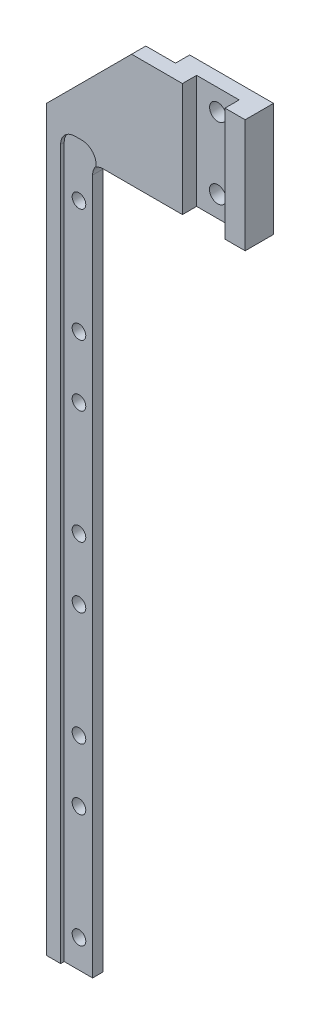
ISO-10303-21;
HEADER;
FILE_DESCRIPTION(('STEP AP214'),'2;1');
FILE_NAME('part.step','',(''),(''),'','','');
FILE_SCHEMA(('AUTOMOTIVE_DESIGN { 1 0 10303 214 1 1 1 1 }'));
ENDSEC;
DATA;
#1=APPLICATION_CONTEXT('core data for automotive mechanical design processes');
#2=APPLICATION_PROTOCOL_DEFINITION('international standard','automotive_design',2000,#1);
#3=PRODUCT_CONTEXT('',#1,'mechanical');
#4=PRODUCT('Part','Part','',(#3));
#5=PRODUCT_RELATED_PRODUCT_CATEGORY('part','',(#4));
#6=PRODUCT_DEFINITION_FORMATION('','',#4);
#7=PRODUCT_DEFINITION_CONTEXT('part definition',#1,'design');
#8=PRODUCT_DEFINITION('design','',#6,#7);
#9=PRODUCT_DEFINITION_SHAPE('','',#8);
#10=(LENGTH_UNIT() NAMED_UNIT(*) SI_UNIT(.MILLI.,.METRE.));
#11=(NAMED_UNIT(*) PLANE_ANGLE_UNIT() SI_UNIT($,.RADIAN.));
#12=(NAMED_UNIT(*) SI_UNIT($,.STERADIAN.) SOLID_ANGLE_UNIT());
#13=UNCERTAINTY_MEASURE_WITH_UNIT(LENGTH_MEASURE(1.E-05),#10,'distance_accuracy_value','');
#14=(GEOMETRIC_REPRESENTATION_CONTEXT(3) GLOBAL_UNCERTAINTY_ASSIGNED_CONTEXT((#13)) GLOBAL_UNIT_ASSIGNED_CONTEXT((#10,
#11,#12)) REPRESENTATION_CONTEXT('',''));
#15=CARTESIAN_POINT('',(0.,0.,0.));
#16=DIRECTION('',(0.,0.,1.));
#17=DIRECTION('',(1.,0.,0.));
#18=AXIS2_PLACEMENT_3D('',#15,#16,#17);
#19=CARTESIAN_POINT('',(-12.7,69.85,3.175));
#20=DIRECTION('',(0.,0.,-1.));
#21=DIRECTION('',(-1.,0.,0.));
#22=AXIS2_PLACEMENT_3D('',#19,#20,#21);
#23=PLANE('',#22);
#24=DIRECTION('',(-1.,0.,0.));
#25=VECTOR('',#24,1.);
#26=CARTESIAN_POINT('',(-7.93750000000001,82.55,3.175));
#27=LINE('',#26,#25);
#28=CARTESIAN_POINT('',(4.7625,82.55,3.175));
#29=VERTEX_POINT('',#28);
#30=CARTESIAN_POINT('',(2.50825,82.5499999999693,3.175));
#31=VERTEX_POINT('',#30);
#32=EDGE_CURVE('E341',#29,#31,#27,.T.);
#33=ORIENTED_EDGE('',*,*,#32,.T.);
#34=DIRECTION('',(0.,-1.,0.));
#35=VECTOR('',#34,1.);
#36=CARTESIAN_POINT('',(2.50825,69.85,3.175));
#37=LINE('',#36,#35);
#38=CARTESIAN_POINT('',(2.50825,69.85,3.175));
#39=VERTEX_POINT('',#38);
#40=EDGE_CURVE('E11',#31,#39,#37,.T.);
#41=ORIENTED_EDGE('',*,*,#40,.T.);
#42=DIRECTION('',(1.,0.,0.));
#43=VECTOR('',#42,1.);
#44=CARTESIAN_POINT('',(-12.7,69.85,3.175));
#45=LINE('',#44,#43);
#46=CARTESIAN_POINT('',(4.7625,69.85,3.175));
#47=VERTEX_POINT('',#46);
#48=EDGE_CURVE('E334',#39,#47,#45,.T.);
#49=ORIENTED_EDGE('',*,*,#48,.T.);
#50=DIRECTION('',(0.,1.,0.));
#51=VECTOR('',#50,1.);
#52=CARTESIAN_POINT('',(4.7625,69.85,3.175));
#53=LINE('',#52,#51);
#54=EDGE_CURVE('E338',#47,#29,#53,.T.);
#55=ORIENTED_EDGE('',*,*,#54,.T.);
#56=EDGE_LOOP('',(#33,#41,#49,#55));
#57=FACE_BOUND('',#56,.T.);
#58=ADVANCED_FACE('F33',(#57),#23,.F.);
#59=CARTESIAN_POINT('',(-12.7,69.85,0.));
#60=DIRECTION('',(0.,0.,-1.));
#61=DIRECTION('',(-1.,0.,0.));
#62=AXIS2_PLACEMENT_3D('',#59,#60,#61);
#63=PLANE('',#62);
#64=DIRECTION('',(0.,-1.,0.));
#65=VECTOR('',#64,1.);
#66=CARTESIAN_POINT('',(-4.61645,69.85,0.));
#67=LINE('',#66,#65);
#68=CARTESIAN_POINT('',(-4.61644999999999,82.55,0.));
#69=VERTEX_POINT('',#68);
#70=CARTESIAN_POINT('',(-4.61644999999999,69.85,0.));
#71=VERTEX_POINT('',#70);
#72=EDGE_CURVE('E230',#69,#71,#67,.T.);
#73=ORIENTED_EDGE('',*,*,#72,.F.);
#74=DIRECTION('',(-1.,0.,0.));
#75=VECTOR('',#74,1.);
#76=CARTESIAN_POINT('',(-7.93750000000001,82.55,0.));
#77=LINE('',#76,#75);
#78=CARTESIAN_POINT('',(4.7625,82.55,0.));
#79=VERTEX_POINT('',#78);
#80=EDGE_CURVE('E193',#79,#69,#77,.T.);
#81=ORIENTED_EDGE('',*,*,#80,.F.);
#82=DIRECTION('',(0.,1.,0.));
#83=VECTOR('',#82,1.);
#84=CARTESIAN_POINT('',(4.7625,69.85,0.));
#85=LINE('',#84,#83);
#86=CARTESIAN_POINT('',(4.7625,69.85,0.));
#87=VERTEX_POINT('',#86);
#88=EDGE_CURVE('E331',#87,#79,#85,.T.);
#89=ORIENTED_EDGE('',*,*,#88,.F.);
#90=DIRECTION('',(1.,0.,0.));
#91=VECTOR('',#90,1.);
#92=CARTESIAN_POINT('',(-12.7,69.85,0.));
#93=LINE('',#92,#91);
#94=EDGE_CURVE('E329',#71,#87,#93,.T.);
#95=ORIENTED_EDGE('',*,*,#94,.F.);
#96=EDGE_LOOP('',(#73,#81,#89,#95));
#97=FACE_BOUND('',#96,.T.);
#98=CARTESIAN_POINT('',(0.111095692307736,72.2122,0.));
#99=DIRECTION('',(0.,0.,-1.));
#100=DIRECTION('',(-1.,0.,0.));
#101=AXIS2_PLACEMENT_3D('',#98,#99,#100);
#102=CIRCLE('',#101,0.927099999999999);
#103=CARTESIAN_POINT('',(-0.816004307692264,72.2122,0.));
#104=VERTEX_POINT('',#103);
#105=EDGE_CURVE('E232',#104,#104,#102,.T.);
#106=ORIENTED_EDGE('',*,*,#105,.F.);
#107=EDGE_LOOP('',(#106));
#108=FACE_BOUND('',#107,.T.);
#109=CARTESIAN_POINT('',(0.123365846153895,80.1878,0.));
#110=DIRECTION('',(0.,0.,-1.));
#111=DIRECTION('',(-1.,0.,0.));
#112=AXIS2_PLACEMENT_3D('',#109,#110,#111);
#113=CIRCLE('',#112,0.927099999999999);
#114=CARTESIAN_POINT('',(-0.803734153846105,80.1878,0.));
#115=VERTEX_POINT('',#114);
#116=EDGE_CURVE('E236',#115,#115,#113,.T.);
#117=ORIENTED_EDGE('',*,*,#116,.F.);
#118=EDGE_LOOP('',(#117));
#119=FACE_BOUND('',#118,.T.);
#120=ADVANCED_FACE('F404',(#97,#108,#119),#63,.T.);
#121=CARTESIAN_POINT('',(-13.49375,69.85,2.778125));
#122=DIRECTION('',(0.,0.,-1.));
#123=DIRECTION('',(-1.,0.,0.));
#124=AXIS2_PLACEMENT_3D('',#121,#122,#123);
#125=PLANE('',#124);
#126=CARTESIAN_POINT('',(-14.224,52.324,2.778125));
#127=DIRECTION('',(0.,0.,1.));
#128=DIRECTION('',(1.,0.,0.));
#129=AXIS2_PLACEMENT_3D('',#126,#127,#128);
#130=CIRCLE('',#129,0.761999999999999);
#131=CARTESIAN_POINT('',(-13.462,52.324,2.778125));
#132=VERTEX_POINT('',#131);
#133=EDGE_CURVE('E263',#132,#132,#130,.T.);
#134=ORIENTED_EDGE('',*,*,#133,.F.);
#135=EDGE_LOOP('',(#134));
#136=FACE_BOUND('',#135,.T.);
#137=CARTESIAN_POINT('',(-14.224,32.766,2.778125));
#138=DIRECTION('',(0.,0.,1.));
#139=DIRECTION('',(1.,0.,0.));
#140=AXIS2_PLACEMENT_3D('',#137,#138,#139);
#141=CIRCLE('',#140,0.761999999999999);
#142=CARTESIAN_POINT('',(-13.462,32.766,2.778125));
#143=VERTEX_POINT('',#142);
#144=EDGE_CURVE('E269',#143,#143,#141,.T.);
#145=ORIENTED_EDGE('',*,*,#144,.F.);
#146=EDGE_LOOP('',(#145));
#147=FACE_BOUND('',#146,.T.);
#148=CARTESIAN_POINT('',(-14.224,13.208,2.778125));
#149=DIRECTION('',(0.,0.,1.));
#150=DIRECTION('',(1.,0.,0.));
#151=AXIS2_PLACEMENT_3D('',#148,#149,#150);
#152=CIRCLE('',#151,0.761999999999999);
#153=CARTESIAN_POINT('',(-13.462,13.208,2.778125));
#154=VERTEX_POINT('',#153);
#155=EDGE_CURVE('E275',#154,#154,#152,.T.);
#156=ORIENTED_EDGE('',*,*,#155,.F.);
#157=EDGE_LOOP('',(#156));
#158=FACE_BOUND('',#157,.T.);
#159=CARTESIAN_POINT('',(-14.224,-6.35,2.778125));
#160=DIRECTION('',(0.,0.,1.));
#161=DIRECTION('',(1.,0.,0.));
#162=AXIS2_PLACEMENT_3D('',#159,#160,#161);
#163=CIRCLE('',#162,0.761999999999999);
#164=CARTESIAN_POINT('',(-13.462,-6.35,2.778125));
#165=VERTEX_POINT('',#164);
#166=EDGE_CURVE('E281',#165,#165,#163,.T.);
#167=ORIENTED_EDGE('',*,*,#166,.F.);
#168=EDGE_LOOP('',(#167));
#169=FACE_BOUND('',#168,.T.);
#170=DIRECTION('',(0.,-1.,0.));
#171=VECTOR('',#170,1.);
#172=CARTESIAN_POINT('',(-12.7,69.85,2.778125));
#173=LINE('',#172,#171);
#174=CARTESIAN_POINT('',(-12.7,68.2625,2.778125));
#175=VERTEX_POINT('',#174);
#176=CARTESIAN_POINT('',(-12.7,-9.52500000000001,2.778125));
#177=VERTEX_POINT('',#176);
#178=EDGE_CURVE('E314',#175,#177,#173,.T.);
#179=ORIENTED_EDGE('',*,*,#178,.F.);
#180=CARTESIAN_POINT('',(-11.1125,68.2625,2.778125));
#181=DIRECTION('',(0.,0.,-1.));
#182=DIRECTION('',(-1.,0.,0.));
#183=AXIS2_PLACEMENT_3D('',#180,#181,#182);
#184=CIRCLE('',#183,1.5875);
#185=CARTESIAN_POINT('',(-11.90625,69.6373153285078,2.778125));
#186=VERTEX_POINT('',#185);
#187=EDGE_CURVE('E374',#186,#175,#184,.F.);
#188=ORIENTED_EDGE('',*,*,#187,.F.);
#189=DIRECTION('',(0.,1.,0.));
#190=VECTOR('',#189,1.);
#191=CARTESIAN_POINT('',(-11.90625,69.85,2.778125));
#192=LINE('',#191,#190);
#193=CARTESIAN_POINT('',(-11.90625,69.85,2.778125));
#194=VERTEX_POINT('',#193);
#195=EDGE_CURVE('E300',#186,#194,#192,.T.);
#196=ORIENTED_EDGE('',*,*,#195,.T.);
#197=CARTESIAN_POINT('',(-13.49375,69.85,2.778125));
#198=DIRECTION('',(0.,0.,1.));
#199=DIRECTION('',(-1.,0.,0.));
#200=AXIS2_PLACEMENT_3D('',#197,#198,#199);
#201=CIRCLE('',#200,1.5875);
#202=CARTESIAN_POINT('',(-13.49375,71.4375,2.778125));
#203=VERTEX_POINT('',#202);
#204=EDGE_CURVE('E302',#194,#203,#201,.T.);
#205=ORIENTED_EDGE('',*,*,#204,.T.);
#206=DIRECTION('',(-1.,0.,0.));
#207=VECTOR('',#206,1.);
#208=CARTESIAN_POINT('',(-13.49375,71.4375,2.778125));
#209=LINE('',#208,#207);
#210=CARTESIAN_POINT('',(-14.2875,71.4375,2.778125));
#211=VERTEX_POINT('',#210);
#212=EDGE_CURVE('E305',#203,#211,#209,.T.);
#213=ORIENTED_EDGE('',*,*,#212,.T.);
#214=CARTESIAN_POINT('',(-14.2875,69.85,2.778125));
#215=DIRECTION('',(0.,0.,1.));
#216=DIRECTION('',(1.,0.,0.));
#217=AXIS2_PLACEMENT_3D('',#214,#215,#216);
#218=CIRCLE('',#217,1.5875);
#219=CARTESIAN_POINT('',(-15.875,69.85,2.778125));
#220=VERTEX_POINT('',#219);
#221=EDGE_CURVE('E308',#211,#220,#218,.T.);
#222=ORIENTED_EDGE('',*,*,#221,.T.);
#223=DIRECTION('',(0.,-1.,0.));
#224=VECTOR('',#223,1.);
#225=CARTESIAN_POINT('',(-15.875,69.85,2.778125));
#226=LINE('',#225,#224);
#227=CARTESIAN_POINT('',(-15.875,-9.52500000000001,2.778125));
#228=VERTEX_POINT('',#227);
#229=EDGE_CURVE('E297',#220,#228,#226,.T.);
#230=ORIENTED_EDGE('',*,*,#229,.T.);
#231=DIRECTION('',(-1.,0.,0.));
#232=VECTOR('',#231,1.);
#233=CARTESIAN_POINT('',(-12.7,-9.52500000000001,2.778125));
#234=LINE('',#233,#232);
#235=EDGE_CURVE('E323',#177,#228,#234,.T.);
#236=ORIENTED_EDGE('',*,*,#235,.F.);
#237=EDGE_LOOP('',(#179,#188,#196,#205,#213,#222,#230,#236));
#238=FACE_BOUND('',#237,.T.);
#239=CARTESIAN_POINT('',(-14.224,6.35,2.778125));
#240=DIRECTION('',(0.,0.,1.));
#241=DIRECTION('',(1.,0.,0.));
#242=AXIS2_PLACEMENT_3D('',#239,#240,#241);
#243=CIRCLE('',#242,0.761999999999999);
#244=CARTESIAN_POINT('',(-13.462,6.35,2.778125));
#245=VERTEX_POINT('',#244);
#246=EDGE_CURVE('E278',#245,#245,#243,.T.);
#247=ORIENTED_EDGE('',*,*,#246,.F.);
#248=EDGE_LOOP('',(#247));
#249=FACE_BOUND('',#248,.T.);
#250=CARTESIAN_POINT('',(-14.224,25.908,2.778125));
#251=DIRECTION('',(0.,0.,1.));
#252=DIRECTION('',(1.,0.,0.));
#253=AXIS2_PLACEMENT_3D('',#250,#251,#252);
#254=CIRCLE('',#253,0.761999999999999);
#255=CARTESIAN_POINT('',(-13.462,25.908,2.778125));
#256=VERTEX_POINT('',#255);
#257=EDGE_CURVE('E272',#256,#256,#254,.T.);
#258=ORIENTED_EDGE('',*,*,#257,.F.);
#259=EDGE_LOOP('',(#258));
#260=FACE_BOUND('',#259,.T.);
#261=CARTESIAN_POINT('',(-14.224,45.466,2.778125));
#262=DIRECTION('',(0.,0.,1.));
#263=DIRECTION('',(1.,0.,0.));
#264=AXIS2_PLACEMENT_3D('',#261,#262,#263);
#265=CIRCLE('',#264,0.761999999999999);
#266=CARTESIAN_POINT('',(-13.462,45.466,2.778125));
#267=VERTEX_POINT('',#266);
#268=EDGE_CURVE('E266',#267,#267,#265,.T.);
#269=ORIENTED_EDGE('',*,*,#268,.F.);
#270=EDGE_LOOP('',(#269));
#271=FACE_BOUND('',#270,.T.);
#272=CARTESIAN_POINT('',(-14.224,65.024,2.778125));
#273=DIRECTION('',(0.,0.,1.));
#274=DIRECTION('',(1.,0.,0.));
#275=AXIS2_PLACEMENT_3D('',#272,#273,#274);
#276=CIRCLE('',#275,0.761999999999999);
#277=CARTESIAN_POINT('',(-13.462,65.024,2.778125));
#278=VERTEX_POINT('',#277);
#279=EDGE_CURVE('E260',#278,#278,#276,.T.);
#280=ORIENTED_EDGE('',*,*,#279,.F.);
#281=EDGE_LOOP('',(#280));
#282=FACE_BOUND('',#281,.T.);
#283=ADVANCED_FACE('F411',(#136,#147,#158,#169,#238,#249,#260,#271,#282),#125,.F.);
#284=CARTESIAN_POINT('',(-12.7,69.85,3.175));
#285=DIRECTION('',(0.,1.,0.));
#286=DIRECTION('',(0.,0.,1.));
#287=AXIS2_PLACEMENT_3D('',#284,#285,#286);
#288=PLANE('',#287);
#289=DIRECTION('',(0.,0.,-1.));
#290=VECTOR('',#289,1.);
#291=CARTESIAN_POINT('',(-11.1125,69.85,0.));
#292=LINE('',#291,#290);
#293=CARTESIAN_POINT('',(-11.1125,69.85,3.175));
#294=VERTEX_POINT('',#293);
#295=CARTESIAN_POINT('',(-11.1125,69.85,1.5875));
#296=VERTEX_POINT('',#295);
#297=EDGE_CURVE('E367',#294,#296,#292,.T.);
#298=ORIENTED_EDGE('',*,*,#297,.T.);
#299=DIRECTION('',(1.,0.,0.));
#300=VECTOR('',#299,1.);
#301=CARTESIAN_POINT('',(-12.7,69.85,1.5875));
#302=LINE('',#301,#300);
#303=CARTESIAN_POINT('',(-4.61644999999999,69.85,1.5875));
#304=VERTEX_POINT('',#303);
#305=EDGE_CURVE('E50',#296,#304,#302,.T.);
#306=ORIENTED_EDGE('',*,*,#305,.T.);
#307=DIRECTION('',(0.,0.,-1.));
#308=VECTOR('',#307,1.);
#309=CARTESIAN_POINT('',(-4.61644999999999,69.85,3.17499999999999));
#310=LINE('',#309,#308);
#311=EDGE_CURVE('E178',#304,#71,#310,.T.);
#312=ORIENTED_EDGE('',*,*,#311,.T.);
#313=ORIENTED_EDGE('',*,*,#94,.T.);
#314=DIRECTION('',(0.,0.,-1.));
#315=VECTOR('',#314,1.);
#316=CARTESIAN_POINT('',(4.7625,69.85,3.175));
#317=LINE('',#316,#315);
#318=EDGE_CURVE('E364',#47,#87,#317,.T.);
#319=ORIENTED_EDGE('',*,*,#318,.F.);
#320=ORIENTED_EDGE('',*,*,#48,.F.);
#321=DIRECTION('',(0.,0.,-1.));
#322=VECTOR('',#321,1.);
#323=CARTESIAN_POINT('',(2.50825,69.85,3.175));
#324=LINE('',#323,#322);
#325=CARTESIAN_POINT('',(2.50825,69.85,1.5875));
#326=VERTEX_POINT('',#325);
#327=EDGE_CURVE('E254',#39,#326,#324,.T.);
#328=ORIENTED_EDGE('',*,*,#327,.T.);
#329=DIRECTION('',(-1.,0.,0.));
#330=VECTOR('',#329,1.);
#331=CARTESIAN_POINT('',(-12.7,69.85,1.5875));
#332=LINE('',#331,#330);
#333=CARTESIAN_POINT('',(-2.25425,69.85,1.5875));
#334=VERTEX_POINT('',#333);
#335=EDGE_CURVE('E257',#326,#334,#332,.T.);
#336=ORIENTED_EDGE('',*,*,#335,.T.);
#337=DIRECTION('',(0.,0.,1.));
#338=VECTOR('',#337,1.);
#339=CARTESIAN_POINT('',(-2.25425,69.85,3.175));
#340=LINE('',#339,#338);
#341=CARTESIAN_POINT('',(-2.25425,69.85,3.175));
#342=VERTEX_POINT('',#341);
#343=EDGE_CURVE('E250',#334,#342,#340,.T.);
#344=ORIENTED_EDGE('',*,*,#343,.T.);
#345=EDGE_CURVE('E335',#294,#342,#45,.T.);
#346=ORIENTED_EDGE('',*,*,#345,.F.);
#347=EDGE_LOOP('',(#298,#306,#312,#313,#319,#320,#328,#336,#344,#346));
#348=FACE_BOUND('',#347,.T.);
#349=ADVANCED_FACE('F35',(#348),#288,.F.);
#350=CARTESIAN_POINT('',(4.7625,69.85,3.175));
#351=DIRECTION('',(-1.,0.,0.));
#352=DIRECTION('',(0.,-1.,0.));
#353=AXIS2_PLACEMENT_3D('',#350,#351,#352);
#354=PLANE('',#353);
#355=ORIENTED_EDGE('',*,*,#88,.T.);
#356=DIRECTION('',(0.,0.,-1.));
#357=VECTOR('',#356,1.);
#358=CARTESIAN_POINT('',(4.7625,82.55,3.175));
#359=LINE('',#358,#357);
#360=EDGE_CURVE('E362',#29,#79,#359,.T.);
#361=ORIENTED_EDGE('',*,*,#360,.F.);
#362=ORIENTED_EDGE('',*,*,#54,.F.);
#363=ORIENTED_EDGE('',*,*,#318,.T.);
#364=EDGE_LOOP('',(#355,#361,#362,#363));
#365=FACE_BOUND('',#364,.T.);
#366=ADVANCED_FACE('F537',(#365),#354,.F.);
#367=CARTESIAN_POINT('',(-7.93750000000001,82.55,3.175));
#368=DIRECTION('',(0.,-1.,0.));
#369=DIRECTION('',(0.,0.,-1.));
#370=AXIS2_PLACEMENT_3D('',#367,#368,#369);
#371=PLANE('',#370);
#372=DIRECTION('',(0.,0.,1.));
#373=VECTOR('',#372,1.);
#374=CARTESIAN_POINT('',(-4.61644999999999,82.55,1.5875));
#375=LINE('',#374,#373);
#376=CARTESIAN_POINT('',(-4.61644999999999,82.55,1.5875));
#377=VERTEX_POINT('',#376);
#378=EDGE_CURVE('E175',#69,#377,#375,.T.);
#379=ORIENTED_EDGE('',*,*,#378,.T.);
#380=DIRECTION('',(-1.,0.,0.));
#381=VECTOR('',#380,1.);
#382=CARTESIAN_POINT('',(-20.2754232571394,82.55,1.5875));
#383=LINE('',#382,#381);
#384=CARTESIAN_POINT('',(-7.93750000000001,82.55,1.5875));
#385=VERTEX_POINT('',#384);
#386=EDGE_CURVE('E179',#377,#385,#383,.T.);
#387=ORIENTED_EDGE('',*,*,#386,.T.);
#388=DIRECTION('',(0.,0.,-1.));
#389=VECTOR('',#388,1.);
#390=CARTESIAN_POINT('',(-7.93750000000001,82.55,3.175));
#391=LINE('',#390,#389);
#392=CARTESIAN_POINT('',(-7.93750000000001,82.55,3.175));
#393=VERTEX_POINT('',#392);
#394=EDGE_CURVE('E360',#393,#385,#391,.T.);
#395=ORIENTED_EDGE('',*,*,#394,.F.);
#396=CARTESIAN_POINT('',(-2.25425,82.55,3.175));
#397=VERTEX_POINT('',#396);
#398=EDGE_CURVE('E340',#397,#393,#27,.T.);
#399=ORIENTED_EDGE('',*,*,#398,.F.);
#400=DIRECTION('',(0.,0.,1.));
#401=VECTOR('',#400,1.);
#402=CARTESIAN_POINT('',(-2.25425,82.5499999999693,6.1515625));
#403=LINE('',#402,#401);
#404=CARTESIAN_POINT('',(-2.25425,82.5499999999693,1.5875));
#405=VERTEX_POINT('',#404);
#406=EDGE_CURVE('E58',#405,#397,#403,.T.);
#407=ORIENTED_EDGE('',*,*,#406,.F.);
#408=DIRECTION('',(-1.,0.,0.));
#409=VECTOR('',#408,1.);
#410=CARTESIAN_POINT('',(2.50825,82.5499999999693,1.5875));
#411=LINE('',#410,#409);
#412=CARTESIAN_POINT('',(2.50825,82.5499999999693,1.5875));
#413=VERTEX_POINT('',#412);
#414=EDGE_CURVE('E243',#413,#405,#411,.T.);
#415=ORIENTED_EDGE('',*,*,#414,.F.);
#416=DIRECTION('',(0.,0.,-1.));
#417=VECTOR('',#416,1.);
#418=CARTESIAN_POINT('',(2.50825,82.5499999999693,6.1515625));
#419=LINE('',#418,#417);
#420=EDGE_CURVE('E240',#31,#413,#419,.T.);
#421=ORIENTED_EDGE('',*,*,#420,.F.);
#422=ORIENTED_EDGE('',*,*,#32,.F.);
#423=ORIENTED_EDGE('',*,*,#360,.T.);
#424=ORIENTED_EDGE('',*,*,#80,.T.);
#425=EDGE_LOOP('',(#379,#387,#395,#399,#407,#415,#421,#422,#423,#424));
#426=FACE_BOUND('',#425,.T.);
#427=ADVANCED_FACE('F190',(#426),#371,.F.);
#428=CARTESIAN_POINT('',(-7.93750000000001,82.55,3.175));
#429=DIRECTION('',(0.707106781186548,-0.707106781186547,0.));
#430=DIRECTION('',(0.707106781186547,0.707106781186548,0.));
#431=AXIS2_PLACEMENT_3D('',#428,#429,#430);
#432=PLANE('',#431);
#433=ORIENTED_EDGE('',*,*,#394,.T.);
#434=DIRECTION('',(-0.707106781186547,-0.707106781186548,0.));
#435=VECTOR('',#434,1.);
#436=CARTESIAN_POINT('',(-7.93750000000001,82.55,1.5875));
#437=LINE('',#436,#435);
#438=CARTESIAN_POINT('',(-17.4625,73.025,1.5875));
#439=VERTEX_POINT('',#438);
#440=EDGE_CURVE('E184',#385,#439,#437,.T.);
#441=ORIENTED_EDGE('',*,*,#440,.T.);
#442=DIRECTION('',(0.,0.,-1.));
#443=VECTOR('',#442,1.);
#444=CARTESIAN_POINT('',(-17.4625,73.025,3.175));
#445=LINE('',#444,#443);
#446=CARTESIAN_POINT('',(-17.4625,73.025,3.175));
#447=VERTEX_POINT('',#446);
#448=EDGE_CURVE('E357',#447,#439,#445,.T.);
#449=ORIENTED_EDGE('',*,*,#448,.F.);
#450=DIRECTION('',(-0.707106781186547,-0.707106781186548,0.));
#451=VECTOR('',#450,1.);
#452=CARTESIAN_POINT('',(-7.93750000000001,82.55,3.175));
#453=LINE('',#452,#451);
#454=EDGE_CURVE('E344',#393,#447,#453,.T.);
#455=ORIENTED_EDGE('',*,*,#454,.F.);
#456=EDGE_LOOP('',(#433,#441,#449,#455));
#457=FACE_BOUND('',#456,.T.);
#458=ADVANCED_FACE('F447',(#457),#432,.F.);
#459=CARTESIAN_POINT('',(-17.4625,73.025,3.175));
#460=DIRECTION('',(1.,0.,0.));
#461=DIRECTION('',(0.,1.,0.));
#462=AXIS2_PLACEMENT_3D('',#459,#460,#461);
#463=PLANE('',#462);
#464=ORIENTED_EDGE('',*,*,#448,.T.);
#465=DIRECTION('',(0.,-1.,0.));
#466=VECTOR('',#465,1.);
#467=CARTESIAN_POINT('',(-17.4625,73.025,1.5875));
#468=LINE('',#467,#466);
#469=CARTESIAN_POINT('',(-17.4625,-9.52500000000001,1.5875));
#470=VERTEX_POINT('',#469);
#471=EDGE_CURVE('E225',#439,#470,#468,.T.);
#472=ORIENTED_EDGE('',*,*,#471,.T.);
#473=DIRECTION('',(0.,0.,-1.));
#474=VECTOR('',#473,1.);
#475=CARTESIAN_POINT('',(-17.4625,-9.52500000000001,3.175));
#476=LINE('',#475,#474);
#477=CARTESIAN_POINT('',(-17.4625,-9.52500000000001,3.175));
#478=VERTEX_POINT('',#477);
#479=EDGE_CURVE('E354',#478,#470,#476,.T.);
#480=ORIENTED_EDGE('',*,*,#479,.F.);
#481=DIRECTION('',(0.,-1.,0.));
#482=VECTOR('',#481,1.);
#483=CARTESIAN_POINT('',(-17.4625,73.025,3.175));
#484=LINE('',#483,#482);
#485=EDGE_CURVE('E346',#447,#478,#484,.T.);
#486=ORIENTED_EDGE('',*,*,#485,.F.);
#487=EDGE_LOOP('',(#464,#472,#480,#486));
#488=FACE_BOUND('',#487,.T.);
#489=ADVANCED_FACE('F442',(#488),#463,.F.);
#490=CARTESIAN_POINT('',(-12.7,-9.52500000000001,3.175));
#491=DIRECTION('',(0.,1.,0.));
#492=DIRECTION('',(0.,0.,1.));
#493=AXIS2_PLACEMENT_3D('',#490,#491,#492);
#494=PLANE('',#493);
#495=ORIENTED_EDGE('',*,*,#479,.T.);
#496=DIRECTION('',(-1.,0.,0.));
#497=VECTOR('',#496,1.);
#498=CARTESIAN_POINT('',(-20.2754232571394,-9.52500000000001,1.5875));
#499=LINE('',#498,#497);
#500=CARTESIAN_POINT('',(-12.7,-9.52500000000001,1.5875));
#501=VERTEX_POINT('',#500);
#502=EDGE_CURVE('E194',#501,#470,#499,.T.);
#503=ORIENTED_EDGE('',*,*,#502,.F.);
#504=DIRECTION('',(0.,0.,-1.));
#505=VECTOR('',#504,1.);
#506=CARTESIAN_POINT('',(-12.7,-9.52500000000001,3.175));
#507=LINE('',#506,#505);
#508=EDGE_CURVE('E351',#177,#501,#507,.T.);
#509=ORIENTED_EDGE('',*,*,#508,.F.);
#510=ORIENTED_EDGE('',*,*,#235,.T.);
#511=DIRECTION('',(0.,0.,1.));
#512=VECTOR('',#511,1.);
#513=CARTESIAN_POINT('',(-15.875,-9.52500000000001,3.175));
#514=LINE('',#513,#512);
#515=CARTESIAN_POINT('',(-15.875,-9.52500000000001,3.175));
#516=VERTEX_POINT('',#515);
#517=EDGE_CURVE('E326',#228,#516,#514,.T.);
#518=ORIENTED_EDGE('',*,*,#517,.T.);
#519=DIRECTION('',(1.,0.,0.));
#520=VECTOR('',#519,1.);
#521=CARTESIAN_POINT('',(-12.7,-9.52500000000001,3.175));
#522=LINE('',#521,#520);
#523=EDGE_CURVE('E348',#478,#516,#522,.T.);
#524=ORIENTED_EDGE('',*,*,#523,.F.);
#525=EDGE_LOOP('',(#495,#503,#509,#510,#518,#524));
#526=FACE_BOUND('',#525,.T.);
#527=ADVANCED_FACE('F426',(#526),#494,.F.);
#528=CARTESIAN_POINT('',(-12.7,69.85,3.175));
#529=DIRECTION('',(-1.,0.,0.));
#530=DIRECTION('',(0.,-1.,0.));
#531=AXIS2_PLACEMENT_3D('',#528,#529,#530);
#532=PLANE('',#531);
#533=ORIENTED_EDGE('',*,*,#508,.T.);
#534=DIRECTION('',(0.,1.,0.));
#535=VECTOR('',#534,1.);
#536=CARTESIAN_POINT('',(-12.7,69.85,1.5875));
#537=LINE('',#536,#535);
#538=CARTESIAN_POINT('',(-12.7,68.2625,1.5875));
#539=VERTEX_POINT('',#538);
#540=EDGE_CURVE('E221',#501,#539,#537,.T.);
#541=ORIENTED_EDGE('',*,*,#540,.T.);
#542=DIRECTION('',(0.,0.,-1.));
#543=VECTOR('',#542,1.);
#544=CARTESIAN_POINT('',(-12.7,68.2625,3.175));
#545=LINE('',#544,#543);
#546=EDGE_CURVE('E370',#539,#175,#545,.F.);
#547=ORIENTED_EDGE('',*,*,#546,.T.);
#548=ORIENTED_EDGE('',*,*,#178,.T.);
#549=EDGE_LOOP('',(#533,#541,#547,#548));
#550=FACE_BOUND('',#549,.T.);
#551=ADVANCED_FACE('F417',(#550),#532,.F.);
#552=ORIENTED_EDGE('',*,*,#345,.T.);
#553=DIRECTION('',(0.,1.,0.));
#554=VECTOR('',#553,1.);
#555=CARTESIAN_POINT('',(-2.25425,69.85,3.175));
#556=LINE('',#555,#554);
#557=EDGE_CURVE('E42',#342,#397,#556,.T.);
#558=ORIENTED_EDGE('',*,*,#557,.T.);
#559=ORIENTED_EDGE('',*,*,#398,.T.);
#560=ORIENTED_EDGE('',*,*,#454,.T.);
#561=ORIENTED_EDGE('',*,*,#485,.T.);
#562=ORIENTED_EDGE('',*,*,#523,.T.);
#563=DIRECTION('',(0.,-1.,0.));
#564=VECTOR('',#563,1.);
#565=CARTESIAN_POINT('',(-15.875,69.85,3.175));
#566=LINE('',#565,#564);
#567=CARTESIAN_POINT('',(-15.875,69.85,3.175));
#568=VERTEX_POINT('',#567);
#569=EDGE_CURVE('E284',#568,#516,#566,.T.);
#570=ORIENTED_EDGE('',*,*,#569,.F.);
#571=CARTESIAN_POINT('',(-14.2875,69.85,3.175));
#572=DIRECTION('',(0.,0.,1.));
#573=DIRECTION('',(1.,0.,0.));
#574=AXIS2_PLACEMENT_3D('',#571,#572,#573);
#575=CIRCLE('',#574,1.5875);
#576=CARTESIAN_POINT('',(-14.2875,71.4375,3.175));
#577=VERTEX_POINT('',#576);
#578=EDGE_CURVE('E294',#577,#568,#575,.T.);
#579=ORIENTED_EDGE('',*,*,#578,.F.);
#580=DIRECTION('',(-1.,0.,0.));
#581=VECTOR('',#580,1.);
#582=CARTESIAN_POINT('',(-13.49375,71.4375,3.175));
#583=LINE('',#582,#581);
#584=CARTESIAN_POINT('',(-13.49375,71.4375,3.175));
#585=VERTEX_POINT('',#584);
#586=EDGE_CURVE('E291',#585,#577,#583,.T.);
#587=ORIENTED_EDGE('',*,*,#586,.F.);
#588=CARTESIAN_POINT('',(-13.49375,69.85,3.175));
#589=DIRECTION('',(0.,0.,1.));
#590=DIRECTION('',(-1.,0.,0.));
#591=AXIS2_PLACEMENT_3D('',#588,#589,#590);
#592=CIRCLE('',#591,1.5875);
#593=CARTESIAN_POINT('',(-11.90625,69.85,3.175));
#594=VERTEX_POINT('',#593);
#595=EDGE_CURVE('E288',#594,#585,#592,.T.);
#596=ORIENTED_EDGE('',*,*,#595,.F.);
#597=DIRECTION('',(0.,1.,0.));
#598=VECTOR('',#597,1.);
#599=CARTESIAN_POINT('',(-11.90625,69.85,3.175));
#600=LINE('',#599,#598);
#601=CARTESIAN_POINT('',(-11.90625,69.6373153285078,3.175));
#602=VERTEX_POINT('',#601);
#603=EDGE_CURVE('E286',#602,#594,#600,.T.);
#604=ORIENTED_EDGE('',*,*,#603,.F.);
#605=CARTESIAN_POINT('',(-11.1125,68.2625,3.175));
#606=DIRECTION('',(0.,0.,-1.));
#607=DIRECTION('',(-1.,0.,0.));
#608=AXIS2_PLACEMENT_3D('',#605,#606,#607);
#609=CIRCLE('',#608,1.5875);
#610=EDGE_CURVE('E372',#602,#294,#609,.T.);
#611=ORIENTED_EDGE('',*,*,#610,.T.);
#612=EDGE_LOOP('',(#552,#558,#559,#560,#561,#562,#570,#579,#587,#596,#604,#611));
#613=FACE_BOUND('',#612,.T.);
#614=ADVANCED_FACE('F407',(#613),#23,.F.);
#615=CARTESIAN_POINT('',(-11.1125,68.2625,3.175));
#616=DIRECTION('',(0.,0.,1.));
#617=DIRECTION('',(1.,0.,0.));
#618=AXIS2_PLACEMENT_3D('',#615,#616,#617);
#619=CYLINDRICAL_SURFACE('',#618,1.5875);
#620=ORIENTED_EDGE('',*,*,#546,.F.);
#621=CARTESIAN_POINT('',(-11.1125,68.2625,1.5875));
#622=DIRECTION('',(0.,0.,1.));
#623=DIRECTION('',(0.,-1.,0.));
#624=AXIS2_PLACEMENT_3D('',#621,#622,#623);
#625=CIRCLE('',#624,1.5875);
#626=EDGE_CURVE('E219',#539,#296,#625,.F.);
#627=ORIENTED_EDGE('',*,*,#626,.T.);
#628=ORIENTED_EDGE('',*,*,#297,.F.);
#629=ORIENTED_EDGE('',*,*,#610,.F.);
#630=DIRECTION('',(0.,0.,1.));
#631=VECTOR('',#630,1.);
#632=CARTESIAN_POINT('',(-11.90625,69.6373153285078,3.175));
#633=LINE('',#632,#631);
#634=EDGE_CURVE('E377',#602,#186,#633,.F.);
#635=ORIENTED_EDGE('',*,*,#634,.T.);
#636=ORIENTED_EDGE('',*,*,#187,.T.);
#637=EDGE_LOOP('',(#620,#627,#628,#629,#635,#636));
#638=FACE_BOUND('',#637,.T.);
#639=ADVANCED_FACE('F416',(#638),#619,.F.);
#640=CARTESIAN_POINT('',(-15.875,69.85,2.778125));
#641=DIRECTION('',(-1.,0.,0.));
#642=DIRECTION('',(0.,-1.,0.));
#643=AXIS2_PLACEMENT_3D('',#640,#641,#642);
#644=PLANE('',#643);
#645=ORIENTED_EDGE('',*,*,#229,.F.);
#646=DIRECTION('',(0.,0.,1.));
#647=VECTOR('',#646,1.);
#648=CARTESIAN_POINT('',(-15.875,69.85,2.778125));
#649=LINE('',#648,#647);
#650=EDGE_CURVE('E312',#220,#568,#649,.T.);
#651=ORIENTED_EDGE('',*,*,#650,.T.);
#652=ORIENTED_EDGE('',*,*,#569,.T.);
#653=ORIENTED_EDGE('',*,*,#517,.F.);
#654=EDGE_LOOP('',(#645,#651,#652,#653));
#655=FACE_BOUND('',#654,.T.);
#656=ADVANCED_FACE('F423',(#655),#644,.F.);
#657=CARTESIAN_POINT('',(-11.90625,69.85,2.778125));
#658=DIRECTION('',(1.,0.,0.));
#659=DIRECTION('',(0.,1.,0.));
#660=AXIS2_PLACEMENT_3D('',#657,#658,#659);
#661=PLANE('',#660);
#662=ORIENTED_EDGE('',*,*,#603,.T.);
#663=DIRECTION('',(0.,0.,1.));
#664=VECTOR('',#663,1.);
#665=CARTESIAN_POINT('',(-11.90625,69.85,2.778125));
#666=LINE('',#665,#664);
#667=EDGE_CURVE('E311',#194,#594,#666,.T.);
#668=ORIENTED_EDGE('',*,*,#667,.F.);
#669=ORIENTED_EDGE('',*,*,#195,.F.);
#670=ORIENTED_EDGE('',*,*,#634,.F.);
#671=EDGE_LOOP('',(#662,#668,#669,#670));
#672=FACE_BOUND('',#671,.T.);
#673=ADVANCED_FACE('F469',(#672),#661,.F.);
#674=CARTESIAN_POINT('',(-14.2875,69.85,2.778125));
#675=DIRECTION('',(0.,0.,1.));
#676=DIRECTION('',(1.,0.,0.));
#677=AXIS2_PLACEMENT_3D('',#674,#675,#676);
#678=CYLINDRICAL_SURFACE('',#677,1.5875);
#679=ORIENTED_EDGE('',*,*,#578,.T.);
#680=ORIENTED_EDGE('',*,*,#650,.F.);
#681=ORIENTED_EDGE('',*,*,#221,.F.);
#682=DIRECTION('',(0.,0.,1.));
#683=VECTOR('',#682,1.);
#684=CARTESIAN_POINT('',(-14.2875,71.4375,2.778125));
#685=LINE('',#684,#683);
#686=EDGE_CURVE('E315',#211,#577,#685,.T.);
#687=ORIENTED_EDGE('',*,*,#686,.T.);
#688=EDGE_LOOP('',(#679,#680,#681,#687));
#689=FACE_BOUND('',#688,.T.);
#690=ADVANCED_FACE('F458',(#689),#678,.F.);
#691=CARTESIAN_POINT('',(-13.49375,71.4375,2.778125));
#692=DIRECTION('',(0.,1.,0.));
#693=DIRECTION('',(0.,0.,1.));
#694=AXIS2_PLACEMENT_3D('',#691,#692,#693);
#695=PLANE('',#694);
#696=ORIENTED_EDGE('',*,*,#586,.T.);
#697=ORIENTED_EDGE('',*,*,#686,.F.);
#698=ORIENTED_EDGE('',*,*,#212,.F.);
#699=DIRECTION('',(0.,0.,1.));
#700=VECTOR('',#699,1.);
#701=CARTESIAN_POINT('',(-13.49375,71.4375,2.778125));
#702=LINE('',#701,#700);
#703=EDGE_CURVE('E317',#203,#585,#702,.T.);
#704=ORIENTED_EDGE('',*,*,#703,.T.);
#705=EDGE_LOOP('',(#696,#697,#698,#704));
#706=FACE_BOUND('',#705,.T.);
#707=ADVANCED_FACE('F462',(#706),#695,.F.);
#708=CARTESIAN_POINT('',(-13.49375,69.85,2.778125));
#709=DIRECTION('',(0.,0.,1.));
#710=DIRECTION('',(1.,0.,0.));
#711=AXIS2_PLACEMENT_3D('',#708,#709,#710);
#712=CYLINDRICAL_SURFACE('',#711,1.5875);
#713=ORIENTED_EDGE('',*,*,#595,.T.);
#714=ORIENTED_EDGE('',*,*,#703,.F.);
#715=ORIENTED_EDGE('',*,*,#204,.F.);
#716=ORIENTED_EDGE('',*,*,#667,.T.);
#717=EDGE_LOOP('',(#713,#714,#715,#716));
#718=FACE_BOUND('',#717,.T.);
#719=ADVANCED_FACE('F465',(#718),#712,.F.);
#720=CARTESIAN_POINT('',(-14.224,-6.35,2.778125));
#721=DIRECTION('',(0.,0.,1.));
#722=DIRECTION('',(1.,0.,0.));
#723=AXIS2_PLACEMENT_3D('',#720,#721,#722);
#724=CYLINDRICAL_SURFACE('',#723,0.761999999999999);
#725=CARTESIAN_POINT('',(-14.224,-6.35,1.5875));
#726=DIRECTION('',(0.,0.,1.));
#727=DIRECTION('',(0.,-1.,0.));
#728=AXIS2_PLACEMENT_3D('',#725,#726,#727);
#729=CIRCLE('',#728,0.761999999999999);
#730=CARTESIAN_POINT('',(-14.224,-7.112,1.5875));
#731=VERTEX_POINT('',#730);
#732=EDGE_CURVE('E216',#731,#731,#729,.F.);
#733=ORIENTED_EDGE('',*,*,#732,.T.);
#734=EDGE_LOOP('',(#733));
#735=FACE_BOUND('',#734,.T.);
#736=ORIENTED_EDGE('',*,*,#166,.T.);
#737=EDGE_LOOP('',(#736));
#738=FACE_BOUND('',#737,.T.);
#739=ADVANCED_FACE('F481',(#735,#738),#724,.F.);
#740=CARTESIAN_POINT('',(-14.224,6.35,2.778125));
#741=DIRECTION('',(0.,0.,1.));
#742=DIRECTION('',(1.,0.,0.));
#743=AXIS2_PLACEMENT_3D('',#740,#741,#742);
#744=CYLINDRICAL_SURFACE('',#743,0.761999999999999);
#745=CARTESIAN_POINT('',(-14.224,6.35,1.5875));
#746=DIRECTION('',(0.,0.,1.));
#747=DIRECTION('',(0.,-1.,0.));
#748=AXIS2_PLACEMENT_3D('',#745,#746,#747);
#749=CIRCLE('',#748,0.761999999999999);
#750=CARTESIAN_POINT('',(-14.224,5.588,1.5875));
#751=VERTEX_POINT('',#750);
#752=EDGE_CURVE('E213',#751,#751,#749,.F.);
#753=ORIENTED_EDGE('',*,*,#752,.T.);
#754=EDGE_LOOP('',(#753));
#755=FACE_BOUND('',#754,.T.);
#756=ORIENTED_EDGE('',*,*,#246,.T.);
#757=EDGE_LOOP('',(#756));
#758=FACE_BOUND('',#757,.T.);
#759=ADVANCED_FACE('F489',(#755,#758),#744,.F.);
#760=CARTESIAN_POINT('',(-14.224,13.208,2.778125));
#761=DIRECTION('',(0.,0.,1.));
#762=DIRECTION('',(1.,0.,0.));
#763=AXIS2_PLACEMENT_3D('',#760,#761,#762);
#764=CYLINDRICAL_SURFACE('',#763,0.761999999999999);
#765=CARTESIAN_POINT('',(-14.224,13.208,1.5875));
#766=DIRECTION('',(0.,0.,1.));
#767=DIRECTION('',(0.,-1.,0.));
#768=AXIS2_PLACEMENT_3D('',#765,#766,#767);
#769=CIRCLE('',#768,0.761999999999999);
#770=CARTESIAN_POINT('',(-14.224,12.446,1.5875));
#771=VERTEX_POINT('',#770);
#772=EDGE_CURVE('E210',#771,#771,#769,.F.);
#773=ORIENTED_EDGE('',*,*,#772,.T.);
#774=EDGE_LOOP('',(#773));
#775=FACE_BOUND('',#774,.T.);
#776=ORIENTED_EDGE('',*,*,#155,.T.);
#777=EDGE_LOOP('',(#776));
#778=FACE_BOUND('',#777,.T.);
#779=ADVANCED_FACE('F493',(#775,#778),#764,.F.);
#780=CARTESIAN_POINT('',(-14.224,25.908,2.778125));
#781=DIRECTION('',(0.,0.,1.));
#782=DIRECTION('',(1.,0.,0.));
#783=AXIS2_PLACEMENT_3D('',#780,#781,#782);
#784=CYLINDRICAL_SURFACE('',#783,0.761999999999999);
#785=CARTESIAN_POINT('',(-14.224,25.908,1.5875));
#786=DIRECTION('',(0.,0.,1.));
#787=DIRECTION('',(0.,-1.,0.));
#788=AXIS2_PLACEMENT_3D('',#785,#786,#787);
#789=CIRCLE('',#788,0.761999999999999);
#790=CARTESIAN_POINT('',(-14.224,25.146,1.5875));
#791=VERTEX_POINT('',#790);
#792=EDGE_CURVE('E207',#791,#791,#789,.F.);
#793=ORIENTED_EDGE('',*,*,#792,.T.);
#794=EDGE_LOOP('',(#793));
#795=FACE_BOUND('',#794,.T.);
#796=ORIENTED_EDGE('',*,*,#257,.T.);
#797=EDGE_LOOP('',(#796));
#798=FACE_BOUND('',#797,.T.);
#799=ADVANCED_FACE('F497',(#795,#798),#784,.F.);
#800=CARTESIAN_POINT('',(-14.224,32.766,2.778125));
#801=DIRECTION('',(0.,0.,1.));
#802=DIRECTION('',(1.,0.,0.));
#803=AXIS2_PLACEMENT_3D('',#800,#801,#802);
#804=CYLINDRICAL_SURFACE('',#803,0.761999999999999);
#805=CARTESIAN_POINT('',(-14.224,32.766,1.5875));
#806=DIRECTION('',(0.,0.,1.));
#807=DIRECTION('',(0.,-1.,0.));
#808=AXIS2_PLACEMENT_3D('',#805,#806,#807);
#809=CIRCLE('',#808,0.761999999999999);
#810=CARTESIAN_POINT('',(-14.224,32.004,1.5875));
#811=VERTEX_POINT('',#810);
#812=EDGE_CURVE('E204',#811,#811,#809,.F.);
#813=ORIENTED_EDGE('',*,*,#812,.T.);
#814=EDGE_LOOP('',(#813));
#815=FACE_BOUND('',#814,.T.);
#816=ORIENTED_EDGE('',*,*,#144,.T.);
#817=EDGE_LOOP('',(#816));
#818=FACE_BOUND('',#817,.T.);
#819=ADVANCED_FACE('F501',(#815,#818),#804,.F.);
#820=CARTESIAN_POINT('',(-14.224,45.466,2.778125));
#821=DIRECTION('',(0.,0.,1.));
#822=DIRECTION('',(1.,0.,0.));
#823=AXIS2_PLACEMENT_3D('',#820,#821,#822);
#824=CYLINDRICAL_SURFACE('',#823,0.761999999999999);
#825=CARTESIAN_POINT('',(-14.224,45.466,1.5875));
#826=DIRECTION('',(0.,0.,1.));
#827=DIRECTION('',(0.,-1.,0.));
#828=AXIS2_PLACEMENT_3D('',#825,#826,#827);
#829=CIRCLE('',#828,0.761999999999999);
#830=CARTESIAN_POINT('',(-14.224,44.704,1.5875));
#831=VERTEX_POINT('',#830);
#832=EDGE_CURVE('E201',#831,#831,#829,.F.);
#833=ORIENTED_EDGE('',*,*,#832,.T.);
#834=EDGE_LOOP('',(#833));
#835=FACE_BOUND('',#834,.T.);
#836=ORIENTED_EDGE('',*,*,#268,.T.);
#837=EDGE_LOOP('',(#836));
#838=FACE_BOUND('',#837,.T.);
#839=ADVANCED_FACE('F505',(#835,#838),#824,.F.);
#840=CARTESIAN_POINT('',(-14.224,52.324,2.778125));
#841=DIRECTION('',(0.,0.,1.));
#842=DIRECTION('',(1.,0.,0.));
#843=AXIS2_PLACEMENT_3D('',#840,#841,#842);
#844=CYLINDRICAL_SURFACE('',#843,0.761999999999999);
#845=CARTESIAN_POINT('',(-14.224,52.324,1.5875));
#846=DIRECTION('',(0.,0.,1.));
#847=DIRECTION('',(0.,-1.,0.));
#848=AXIS2_PLACEMENT_3D('',#845,#846,#847);
#849=CIRCLE('',#848,0.761999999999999);
#850=CARTESIAN_POINT('',(-14.224,51.562,1.5875));
#851=VERTEX_POINT('',#850);
#852=EDGE_CURVE('E198',#851,#851,#849,.F.);
#853=ORIENTED_EDGE('',*,*,#852,.T.);
#854=EDGE_LOOP('',(#853));
#855=FACE_BOUND('',#854,.T.);
#856=ORIENTED_EDGE('',*,*,#133,.T.);
#857=EDGE_LOOP('',(#856));
#858=FACE_BOUND('',#857,.T.);
#859=ADVANCED_FACE('F509',(#855,#858),#844,.F.);
#860=CARTESIAN_POINT('',(-14.224,65.024,2.778125));
#861=DIRECTION('',(0.,0.,1.));
#862=DIRECTION('',(1.,0.,0.));
#863=AXIS2_PLACEMENT_3D('',#860,#861,#862);
#864=CYLINDRICAL_SURFACE('',#863,0.761999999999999);
#865=CARTESIAN_POINT('',(-14.224,65.024,1.5875));
#866=DIRECTION('',(0.,0.,1.));
#867=DIRECTION('',(0.,-1.,0.));
#868=AXIS2_PLACEMENT_3D('',#865,#866,#867);
#869=CIRCLE('',#868,0.761999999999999);
#870=CARTESIAN_POINT('',(-14.224,64.262,1.5875));
#871=VERTEX_POINT('',#870);
#872=EDGE_CURVE('E37',#871,#871,#869,.F.);
#873=ORIENTED_EDGE('',*,*,#872,.T.);
#874=EDGE_LOOP('',(#873));
#875=FACE_BOUND('',#874,.T.);
#876=ORIENTED_EDGE('',*,*,#279,.T.);
#877=EDGE_LOOP('',(#876));
#878=FACE_BOUND('',#877,.T.);
#879=ADVANCED_FACE('F513',(#875,#878),#864,.F.);
#880=CARTESIAN_POINT('',(2.50825,-9.52500000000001,1.5875));
#881=DIRECTION('',(0.,0.,-1.));
#882=DIRECTION('',(-1.,0.,0.));
#883=AXIS2_PLACEMENT_3D('',#880,#881,#882);
#884=PLANE('',#883);
#885=CARTESIAN_POINT('',(0.111095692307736,72.2122,1.5875));
#886=DIRECTION('',(0.,0.,-1.));
#887=DIRECTION('',(-1.,0.,0.));
#888=AXIS2_PLACEMENT_3D('',#885,#886,#887);
#889=CIRCLE('',#888,0.927099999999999);
#890=CARTESIAN_POINT('',(-0.816004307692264,72.2122,1.5875));
#891=VERTEX_POINT('',#890);
#892=EDGE_CURVE('E235',#891,#891,#889,.T.);
#893=ORIENTED_EDGE('',*,*,#892,.T.);
#894=EDGE_LOOP('',(#893));
#895=FACE_BOUND('',#894,.T.);
#896=CARTESIAN_POINT('',(0.123365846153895,80.1878,1.5875));
#897=DIRECTION('',(0.,0.,-1.));
#898=DIRECTION('',(-1.,0.,0.));
#899=AXIS2_PLACEMENT_3D('',#896,#897,#898);
#900=CIRCLE('',#899,0.927099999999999);
#901=CARTESIAN_POINT('',(-0.803734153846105,80.1878,1.5875));
#902=VERTEX_POINT('',#901);
#903=EDGE_CURVE('E239',#902,#902,#900,.T.);
#904=ORIENTED_EDGE('',*,*,#903,.T.);
#905=EDGE_LOOP('',(#904));
#906=FACE_BOUND('',#905,.T.);
#907=DIRECTION('',(0.,1.,0.));
#908=VECTOR('',#907,1.);
#909=CARTESIAN_POINT('',(2.50825,-9.52500000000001,1.5875));
#910=LINE('',#909,#908);
#911=EDGE_CURVE('E247',#326,#413,#910,.T.);
#912=ORIENTED_EDGE('',*,*,#911,.T.);
#913=ORIENTED_EDGE('',*,*,#414,.T.);
#914=DIRECTION('',(0.,1.,0.));
#915=VECTOR('',#914,1.);
#916=CARTESIAN_POINT('',(-2.25425,-9.52500000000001,1.5875));
#917=LINE('',#916,#915);
#918=EDGE_CURVE('E248',#334,#405,#917,.T.);
#919=ORIENTED_EDGE('',*,*,#918,.F.);
#920=ORIENTED_EDGE('',*,*,#335,.F.);
#921=EDGE_LOOP('',(#912,#913,#919,#920));
#922=FACE_BOUND('',#921,.T.);
#923=ADVANCED_FACE('F385',(#895,#906,#922),#884,.F.);
#924=CARTESIAN_POINT('',(2.50825,-9.52500000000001,6.1515625));
#925=DIRECTION('',(1.,0.,0.));
#926=DIRECTION('',(0.,0.,-1.));
#927=AXIS2_PLACEMENT_3D('',#924,#925,#926);
#928=PLANE('',#927);
#929=ORIENTED_EDGE('',*,*,#40,.F.);
#930=ORIENTED_EDGE('',*,*,#420,.T.);
#931=ORIENTED_EDGE('',*,*,#911,.F.);
#932=ORIENTED_EDGE('',*,*,#327,.F.);
#933=EDGE_LOOP('',(#929,#930,#931,#932));
#934=FACE_BOUND('',#933,.T.);
#935=ADVANCED_FACE('F518',(#934),#928,.F.);
#936=CARTESIAN_POINT('',(-2.25425,-9.52500000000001,6.1515625));
#937=DIRECTION('',(-1.,0.,0.));
#938=DIRECTION('',(0.,0.,1.));
#939=AXIS2_PLACEMENT_3D('',#936,#937,#938);
#940=PLANE('',#939);
#941=ORIENTED_EDGE('',*,*,#918,.T.);
#942=ORIENTED_EDGE('',*,*,#406,.T.);
#943=ORIENTED_EDGE('',*,*,#557,.F.);
#944=ORIENTED_EDGE('',*,*,#343,.F.);
#945=EDGE_LOOP('',(#941,#942,#943,#944));
#946=FACE_BOUND('',#945,.T.);
#947=ADVANCED_FACE('F399',(#946),#940,.F.);
#948=CARTESIAN_POINT('',(0.123365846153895,80.1878,0.));
#949=DIRECTION('',(0.,0.,-1.));
#950=DIRECTION('',(-1.,0.,0.));
#951=AXIS2_PLACEMENT_3D('',#948,#949,#950);
#952=CYLINDRICAL_SURFACE('',#951,0.927099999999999);
#953=ORIENTED_EDGE('',*,*,#116,.T.);
#954=EDGE_LOOP('',(#953));
#955=FACE_BOUND('',#954,.T.);
#956=ORIENTED_EDGE('',*,*,#903,.F.);
#957=EDGE_LOOP('',(#956));
#958=FACE_BOUND('',#957,.T.);
#959=ADVANCED_FACE('F390',(#955,#958),#952,.F.);
#960=CARTESIAN_POINT('',(0.111095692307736,72.2122,0.));
#961=DIRECTION('',(0.,0.,-1.));
#962=DIRECTION('',(-1.,0.,0.));
#963=AXIS2_PLACEMENT_3D('',#960,#961,#962);
#964=CYLINDRICAL_SURFACE('',#963,0.927099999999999);
#965=ORIENTED_EDGE('',*,*,#105,.T.);
#966=EDGE_LOOP('',(#965));
#967=FACE_BOUND('',#966,.T.);
#968=ORIENTED_EDGE('',*,*,#892,.F.);
#969=EDGE_LOOP('',(#968));
#970=FACE_BOUND('',#969,.T.);
#971=ADVANCED_FACE('F388',(#967,#970),#964,.F.);
#972=CARTESIAN_POINT('',(-20.2754232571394,82.55,1.5875));
#973=DIRECTION('',(0.,0.,1.));
#974=DIRECTION('',(0.,-1.,0.));
#975=AXIS2_PLACEMENT_3D('',#972,#973,#974);
#976=PLANE('',#975);
#977=ORIENTED_EDGE('',*,*,#752,.F.);
#978=EDGE_LOOP('',(#977));
#979=FACE_BOUND('',#978,.T.);
#980=ORIENTED_EDGE('',*,*,#792,.F.);
#981=EDGE_LOOP('',(#980));
#982=FACE_BOUND('',#981,.T.);
#983=ORIENTED_EDGE('',*,*,#832,.F.);
#984=EDGE_LOOP('',(#983));
#985=FACE_BOUND('',#984,.T.);
#986=ORIENTED_EDGE('',*,*,#872,.F.);
#987=EDGE_LOOP('',(#986));
#988=FACE_BOUND('',#987,.T.);
#989=ORIENTED_EDGE('',*,*,#852,.F.);
#990=EDGE_LOOP('',(#989));
#991=FACE_BOUND('',#990,.T.);
#992=ORIENTED_EDGE('',*,*,#812,.F.);
#993=EDGE_LOOP('',(#992));
#994=FACE_BOUND('',#993,.T.);
#995=ORIENTED_EDGE('',*,*,#772,.F.);
#996=EDGE_LOOP('',(#995));
#997=FACE_BOUND('',#996,.T.);
#998=ORIENTED_EDGE('',*,*,#732,.F.);
#999=EDGE_LOOP('',(#998));
#1000=FACE_BOUND('',#999,.T.);
#1001=ORIENTED_EDGE('',*,*,#386,.F.);
#1002=DIRECTION('',(0.,-1.,0.));
#1003=VECTOR('',#1002,1.);
#1004=CARTESIAN_POINT('',(-4.61644999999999,82.55,1.5875));
#1005=LINE('',#1004,#1003);
#1006=EDGE_CURVE('E171',#377,#304,#1005,.T.);
#1007=ORIENTED_EDGE('',*,*,#1006,.T.);
#1008=ORIENTED_EDGE('',*,*,#305,.F.);
#1009=ORIENTED_EDGE('',*,*,#626,.F.);
#1010=ORIENTED_EDGE('',*,*,#540,.F.);
#1011=ORIENTED_EDGE('',*,*,#502,.T.);
#1012=ORIENTED_EDGE('',*,*,#471,.F.);
#1013=ORIENTED_EDGE('',*,*,#440,.F.);
#1014=EDGE_LOOP('',(#1001,#1007,#1008,#1009,#1010,#1011,#1012,#1013));
#1015=FACE_BOUND('',#1014,.T.);
#1016=ADVANCED_FACE('F182',(#979,#982,#985,#988,#991,#994,#997,#1000,#1015),#976,.F.);
#1017=CARTESIAN_POINT('',(-4.61644999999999,82.55,1.5875));
#1018=DIRECTION('',(1.,0.,0.));
#1019=DIRECTION('',(0.,0.,-1.));
#1020=AXIS2_PLACEMENT_3D('',#1017,#1018,#1019);
#1021=PLANE('',#1020);
#1022=ORIENTED_EDGE('',*,*,#72,.T.);
#1023=ORIENTED_EDGE('',*,*,#311,.F.);
#1024=ORIENTED_EDGE('',*,*,#1006,.F.);
#1025=ORIENTED_EDGE('',*,*,#378,.F.);
#1026=EDGE_LOOP('',(#1022,#1023,#1024,#1025));
#1027=FACE_BOUND('',#1026,.T.);
#1028=ADVANCED_FACE('F173',(#1027),#1021,.F.);
#1029=CLOSED_SHELL('',(#58,#120,#283,#349,#366,#427,#458,#489,#527,#551,#614,#639,#656,#673,
#690,#707,#719,#739,#759,#779,#799,#819,#839,#859,#879,#923,#935,#947,#959,#971,#1016,#1028));
#1030=MANIFOLD_SOLID_BREP('B2',#1029);
#1031=ADVANCED_BREP_SHAPE_REPRESENTATION('',(#18,#1030),#14);
#1032=SHAPE_DEFINITION_REPRESENTATION(#9,#1031);
ENDSEC;
END-ISO-10303-21;
